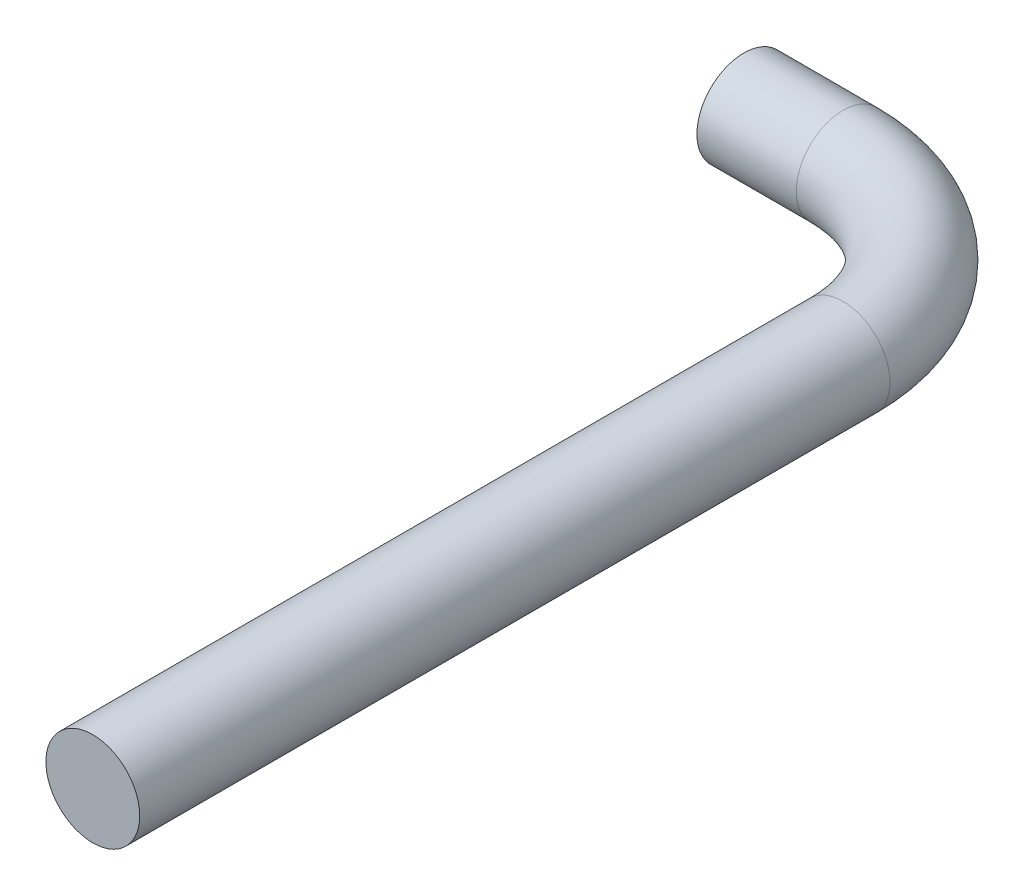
ISO-10303-21;
HEADER;
FILE_DESCRIPTION(('STEP AP214'),'2;1');
FILE_NAME('part.step','',(''),(''),'','','');
FILE_SCHEMA(('AUTOMOTIVE_DESIGN { 1 0 10303 214 1 1 1 1 }'));
ENDSEC;
DATA;
#1=APPLICATION_CONTEXT('core data for automotive mechanical design processes');
#2=APPLICATION_PROTOCOL_DEFINITION('international standard','automotive_design',2000,#1);
#3=PRODUCT_CONTEXT('',#1,'mechanical');
#4=PRODUCT('Part','Part','',(#3));
#5=PRODUCT_RELATED_PRODUCT_CATEGORY('part','',(#4));
#6=PRODUCT_DEFINITION_FORMATION('','',#4);
#7=PRODUCT_DEFINITION_CONTEXT('part definition',#1,'design');
#8=PRODUCT_DEFINITION('design','',#6,#7);
#9=PRODUCT_DEFINITION_SHAPE('','',#8);
#10=(LENGTH_UNIT() NAMED_UNIT(*) SI_UNIT(.MILLI.,.METRE.));
#11=(NAMED_UNIT(*) PLANE_ANGLE_UNIT() SI_UNIT($,.RADIAN.));
#12=(NAMED_UNIT(*) SI_UNIT($,.STERADIAN.) SOLID_ANGLE_UNIT());
#13=UNCERTAINTY_MEASURE_WITH_UNIT(LENGTH_MEASURE(1.E-05),#10,'distance_accuracy_value','');
#14=(GEOMETRIC_REPRESENTATION_CONTEXT(3) GLOBAL_UNCERTAINTY_ASSIGNED_CONTEXT((#13)) GLOBAL_UNIT_ASSIGNED_CONTEXT((#10,
#11,#12)) REPRESENTATION_CONTEXT('',''));
#15=CARTESIAN_POINT('',(0.,0.,0.));
#16=DIRECTION('',(0.,0.,1.));
#17=DIRECTION('',(1.,0.,0.));
#18=AXIS2_PLACEMENT_3D('',#15,#16,#17);
#19=CARTESIAN_POINT('',(0.,0.,150.));
#20=DIRECTION('',(0.,0.,1.));
#21=DIRECTION('',(1.,0.,0.));
#22=AXIS2_PLACEMENT_3D('',#19,#20,#21);
#23=CYLINDRICAL_SURFACE('',#22,42.5);
#24=CARTESIAN_POINT('',(0.,0.,150.));
#25=DIRECTION('',(0.,0.,-1.));
#26=DIRECTION('',(-1.,0.,0.));
#27=AXIS2_PLACEMENT_3D('',#24,#25,#26);
#28=CIRCLE('',#27,42.5);
#29=CARTESIAN_POINT('',(42.5,0.,150.));
#30=VERTEX_POINT('',#29);
#31=EDGE_CURVE('E9',#30,#30,#28,.T.);
#32=ORIENTED_EDGE('',*,*,#31,.F.);
#33=EDGE_LOOP('',(#32));
#34=FACE_BOUND('',#33,.T.);
#35=CARTESIAN_POINT('',(0.,0.,830.));
#36=DIRECTION('',(0.,0.,1.));
#37=DIRECTION('',(1.,0.,0.));
#38=AXIS2_PLACEMENT_3D('',#35,#36,#37);
#39=CIRCLE('',#38,42.5);
#40=CARTESIAN_POINT('',(42.5,0.,830.));
#41=VERTEX_POINT('',#40);
#42=EDGE_CURVE('E28',#41,#41,#39,.T.);
#43=ORIENTED_EDGE('',*,*,#42,.F.);
#44=EDGE_LOOP('',(#43));
#45=FACE_BOUND('',#44,.T.);
#46=ADVANCED_FACE('F13',(#34,#45),#23,.T.);
#47=CARTESIAN_POINT('',(-150.,0.,150.));
#48=DIRECTION('',(0.,-1.,0.));
#49=DIRECTION('',(0.,0.,-1.));
#50=AXIS2_PLACEMENT_3D('',#47,#48,#49);
#51=TOROIDAL_SURFACE('',#50,150.,42.5);
#52=CARTESIAN_POINT('',(-150.,0.,0.));
#53=DIRECTION('',(-1.,0.,0.));
#54=DIRECTION('',(0.,0.,1.));
#55=AXIS2_PLACEMENT_3D('',#52,#53,#54);
#56=CIRCLE('',#55,42.5);
#57=CARTESIAN_POINT('',(-150.,0.,-42.5));
#58=VERTEX_POINT('',#57);
#59=EDGE_CURVE('E19',#58,#58,#56,.T.);
#60=CARTESIAN_POINT('',(-150.,0.,150.));
#61=DIRECTION('',(0.,-1.,0.));
#62=DIRECTION('',(0.,0.,-1.));
#63=AXIS2_PLACEMENT_3D('',#60,#61,#62);
#64=CIRCLE('',#63,192.5);
#65=EDGE_CURVE('',#58,#30,#64,.T.);
#66=ORIENTED_EDGE('',*,*,#59,.F.);
#67=ORIENTED_EDGE('',*,*,#31,.T.);
#68=ORIENTED_EDGE('',*,*,#65,.T.);
#69=ORIENTED_EDGE('',*,*,#65,.F.);
#70=EDGE_LOOP('',(#66,#68,#67,#69));
#71=FACE_BOUND('',#70,.T.);
#72=ADVANCED_FACE('F36',(#71),#51,.T.);
#73=CARTESIAN_POINT('',(-150.,0.,0.));
#74=DIRECTION('',(-1.,0.,0.));
#75=DIRECTION('',(0.,0.,1.));
#76=AXIS2_PLACEMENT_3D('',#73,#74,#75);
#77=CYLINDRICAL_SURFACE('',#76,42.5);
#78=ORIENTED_EDGE('',*,*,#59,.T.);
#79=EDGE_LOOP('',(#78));
#80=FACE_BOUND('',#79,.T.);
#81=CARTESIAN_POINT('',(-240.,0.,0.));
#82=DIRECTION('',(-1.,0.,0.));
#83=DIRECTION('',(0.,0.,1.));
#84=AXIS2_PLACEMENT_3D('',#81,#82,#83);
#85=CIRCLE('',#84,42.5);
#86=CARTESIAN_POINT('',(-240.,0.,42.5));
#87=VERTEX_POINT('',#86);
#88=EDGE_CURVE('E23',#87,#87,#85,.T.);
#89=ORIENTED_EDGE('',*,*,#88,.F.);
#90=EDGE_LOOP('',(#89));
#91=FACE_BOUND('',#90,.T.);
#92=ADVANCED_FACE('F43',(#80,#91),#77,.T.);
#93=CARTESIAN_POINT('',(-240.,0.,0.));
#94=DIRECTION('',(-1.,0.,0.));
#95=DIRECTION('',(0.,0.,1.));
#96=AXIS2_PLACEMENT_3D('',#93,#94,#95);
#97=PLANE('',#96);
#98=ORIENTED_EDGE('',*,*,#88,.T.);
#99=EDGE_LOOP('',(#98));
#100=FACE_BOUND('',#99,.T.);
#101=ADVANCED_FACE('F49',(#100),#97,.T.);
#102=CARTESIAN_POINT('',(0.,0.,830.));
#103=DIRECTION('',(0.,0.,1.));
#104=DIRECTION('',(1.,0.,0.));
#105=AXIS2_PLACEMENT_3D('',#102,#103,#104);
#106=PLANE('',#105);
#107=ORIENTED_EDGE('',*,*,#42,.T.);
#108=EDGE_LOOP('',(#107));
#109=FACE_BOUND('',#108,.T.);
#110=ADVANCED_FACE('F33',(#109),#106,.T.);
#111=CLOSED_SHELL('',(#46,#72,#92,#101,#110));
#112=MANIFOLD_SOLID_BREP('B1',#111);
#113=ADVANCED_BREP_SHAPE_REPRESENTATION('',(#18,#112),#14);
#114=SHAPE_DEFINITION_REPRESENTATION(#9,#113);
ENDSEC;
END-ISO-10303-21;
